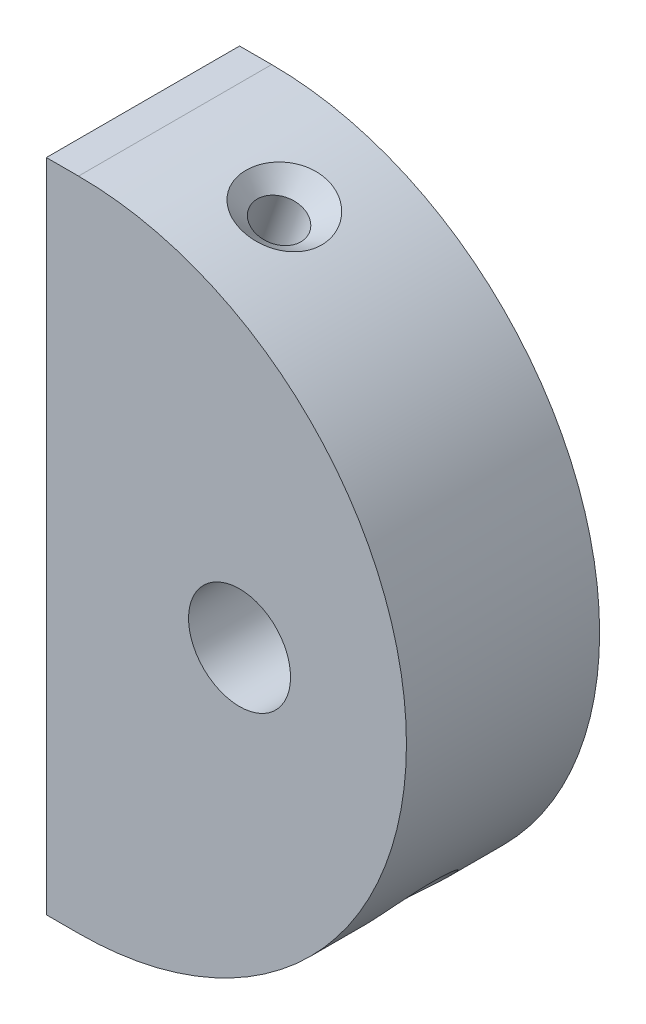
from build123d import *

# Parameters (mm, degrees)
SKETCH1_R                                         = 4.191
BASE_EXTRUDE_DEPTH                                = 7.9375
CSK_FOR_6_FLAT_HEAD_MACHINE_SCREW_100_D           = 3.7973
CSK_FOR_6_FLAT_HEAD_MACHINE_SCREW_100_DEPTH       = 12.7
CSK_FOR_6_FLAT_HEAD_MACHINE_SCREW_100_CSINK_D     = 7.0866
CSK_FOR_6_FLAT_HEAD_MACHINE_SCREW_100_CSINK_ANGLE = 100
CSK_FOR_6_FLAT_HEAD_MACHINE_SCREW_100_TIP         = 1.140824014
CSK_FOR_6_FLAT_HEAD_MACHINE_SCREW_2_D             = 3.7973
CSK_FOR_6_FLAT_HEAD_MACHINE_SCREW_2_DEPTH         = 12.7
CSK_FOR_6_FLAT_HEAD_MACHINE_SCREW_2_CSINK_D       = 7.0866
CSK_FOR_6_FLAT_HEAD_MACHINE_SCREW_2_CSINK_ANGLE   = 100
CSK_FOR_6_FLAT_HEAD_MACHINE_SCREW_2_TIP           = 1.140824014


with BuildPart() as part:
    # Sketch1 → Base-Extrude (new, symmetric)
    with BuildSketch(Plane.XY):
        with BuildLine():
            Line((0, 26.949387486), (2.641612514, 26.949387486))
            ThreePointArc((2.641612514, 26.949387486), (29.591, 0), (2.641612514, -26.949387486))
            Line((2.641612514, -26.949387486), (0, -26.949387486))
            Line((0, -26.949387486), (0, 26.949387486))
        make_face()
        with Locations((15.875, 0)):
            Circle(SKETCH1_R, mode=Mode.SUBTRACT)
    extrude(amount=BASE_EXTRUDE_DEPTH, both=True)

    # CSK for _6 Flat Head Machine Screw _100
    with Locations(Plane(origin=(11.647693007, 25.4, 0), x_dir=(0.942507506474, -0.334184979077, 0), z_dir=(0.334184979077, 0.942507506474, 0))):
        with Locations((0, 0)):
            CounterSinkHole(CSK_FOR_6_FLAT_HEAD_MACHINE_SCREW_100_D / 2, CSK_FOR_6_FLAT_HEAD_MACHINE_SCREW_100_CSINK_D / 2, depth=CSK_FOR_6_FLAT_HEAD_MACHINE_SCREW_100_DEPTH, counter_sink_angle=CSK_FOR_6_FLAT_HEAD_MACHINE_SCREW_100_CSINK_ANGLE)
            with Locations((0, 0, -(CSK_FOR_6_FLAT_HEAD_MACHINE_SCREW_100_DEPTH + CSK_FOR_6_FLAT_HEAD_MACHINE_SCREW_100_TIP / 2))):  # 118° drill point
                Cone(0, CSK_FOR_6_FLAT_HEAD_MACHINE_SCREW_100_D / 2, CSK_FOR_6_FLAT_HEAD_MACHINE_SCREW_100_TIP, mode=Mode.SUBTRACT)

    # CSK for _6 Flat Head Machine Screw _ 2
    with Locations(Plane(origin=(21.703799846, -19.05, 0), x_dir=(0.706880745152, 0.707332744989, 0), z_dir=(0.707332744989, -0.706880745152, 0))):
        with Locations((0, 0)):
            CounterSinkHole(CSK_FOR_6_FLAT_HEAD_MACHINE_SCREW_2_D / 2, CSK_FOR_6_FLAT_HEAD_MACHINE_SCREW_2_CSINK_D / 2, depth=CSK_FOR_6_FLAT_HEAD_MACHINE_SCREW_2_DEPTH, counter_sink_angle=CSK_FOR_6_FLAT_HEAD_MACHINE_SCREW_2_CSINK_ANGLE)
            with Locations((0, 0, -(CSK_FOR_6_FLAT_HEAD_MACHINE_SCREW_2_DEPTH + CSK_FOR_6_FLAT_HEAD_MACHINE_SCREW_2_TIP / 2))):  # 118° drill point
                Cone(0, CSK_FOR_6_FLAT_HEAD_MACHINE_SCREW_2_D / 2, CSK_FOR_6_FLAT_HEAD_MACHINE_SCREW_2_TIP, mode=Mode.SUBTRACT)


solid = part.part
